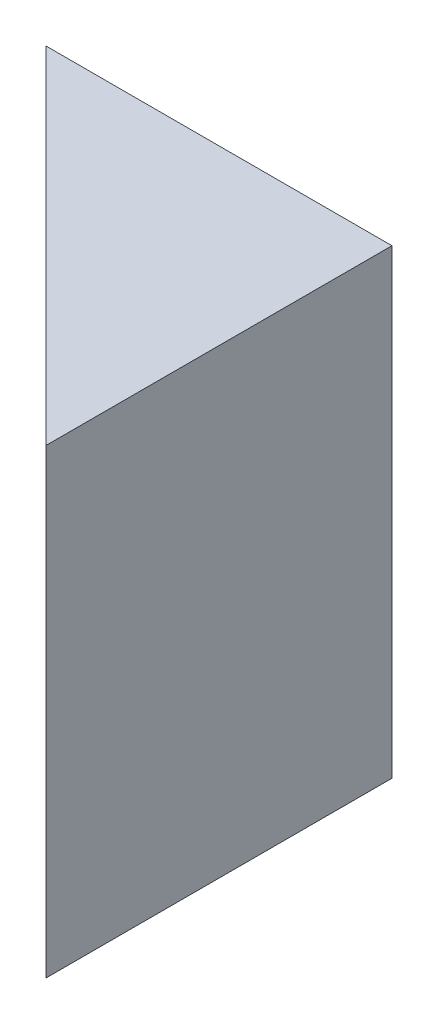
from build123d import *

# Parameters (mm, degrees)
BOSS_EXTRUDE1_DEPTH = 101.6


with BuildPart() as part:
    # Sketch1 → Boss-Extrude1 (new body)
    with BuildSketch(Plane(origin=(0, 0, 0), x_dir=(1, 0, 0), z_dir=(0, 1, 0))):
        Polygon((-38.1, 38.1), (38.1, -38.1), (38.1, 38.1), align=None)
    extrude(amount=BOSS_EXTRUDE1_DEPTH)


solid = part.part
